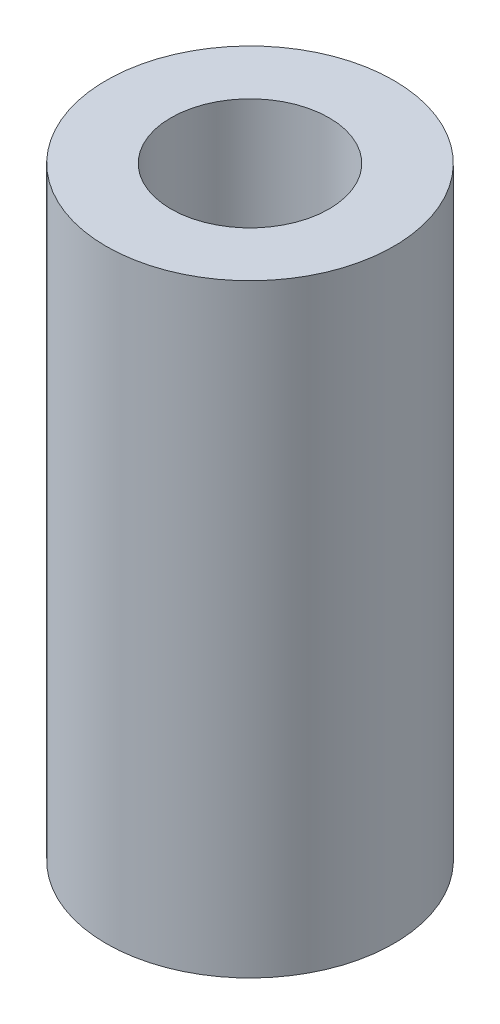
from build123d import *

# Parameters (mm, degrees)
SKETCH1_R      = 5
SKETCH1_R_2    = 2.75
EXTRUDE1_DEPTH = 21


with BuildPart() as part:
    # Sketch1 → Extrude1 (new body)
    with BuildSketch(Plane(origin=(0, 0, 0), x_dir=(1, 0, 0), z_dir=(0, 1, 0))):
        with Locations(Location((0, 0, 0), (0, 0, 90))):
            Circle(SKETCH1_R)
        with Locations(Location((0, 0, 0), (0, 0, 90))):
            Circle(SKETCH1_R_2, mode=Mode.SUBTRACT)
    extrude(amount=EXTRUDE1_DEPTH)


solid = part.part
